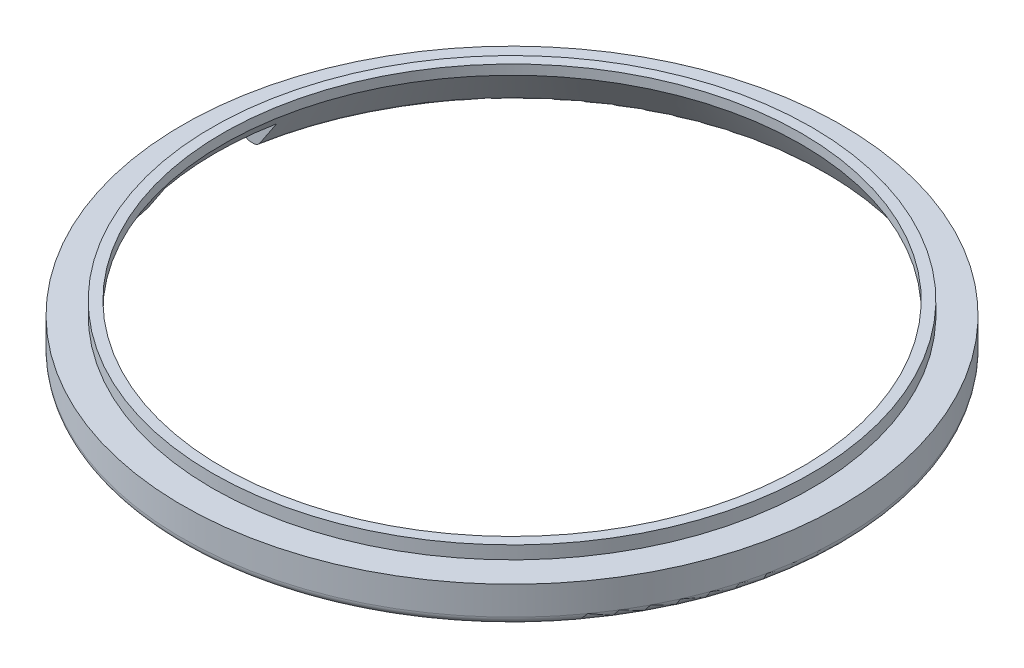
from build123d import *

# Parameters (mm, degrees)
SKETCH1_R           = 12.7
SKETCH1_R_2         = 11.15
BOSS_EXTRUDE1_DEPTH = 1.9
SKETCH2_W           = 4.3
SKETCH2_H           = 1.1
CUT_EXTRUDE1_DEPTH  = 19.060730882
FILLET2_R           = 0.3
SKETCH6_OUTSIDE_W   = 34.594
SKETCH6_OUTSIDE_H   = 34.594
SKETCH6_OUTSIDE_R   = 11.55
CUT_EXTRUDE4_DEPTH  = 0.5


with BuildPart() as part:
    # Sketch1 → Boss-Extrude1 (new body)
    with BuildSketch(Plane(origin=(0, 0, 0), x_dir=(1, 0, 0), z_dir=(0, 1, 0))):
        with Locations(Location((0, 0, 0), (0, 0, 90))):
            Circle(SKETCH1_R)
        with Locations(Location((0, 0, 0), (0, 0, 90))):
            Circle(SKETCH1_R_2, mode=Mode.SUBTRACT)
    extrude(amount=BOSS_EXTRUDE1_DEPTH)

    # Sketch2 → Cut-Extrude1 (cut, through all)
    with BuildSketch(Plane(origin=(0, 0, 0), x_dir=(0, 0, -1), z_dir=(1, 0, 0))):
        with Locations((0, 0.55)):
            Rectangle(SKETCH2_W, SKETCH2_H)
    extrude(amount=-CUT_EXTRUDE1_DEPTH, mode=Mode.SUBTRACT)

    # Sketch5 → Cut-Revolve1 (revolve, cut)
    with BuildSketch(Plane.XY, mode=Mode.PRIVATE) as cut_revolve1_sk:
        Polygon((12.15, 0), (11.15, 1.525253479), (11.15, 0), align=None)
    revolve(cut_revolve1_sk.sketch.rotate(Axis((0, 0, 0), (0, 1, 0)), 90), axis=Axis((0, 0, 0), (0, 1, 0)), mode=Mode.SUBTRACT)

    # Fillet2
    fillet2_edges = [part.edges().sort_by_distance(p)[0] for p in [
        (9.710689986, 0, 8.184894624),
        (9.32054183, 0, 7.794228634),
        (-12.7, 1.1, 0),
    ]]
    fillet(fillet2_edges, radius=FILLET2_R)

    # Sketch6 outside → Cut-Extrude4 (cut)
    with BuildSketch(Plane(origin=(0, 1.9, 0), x_dir=(1, 0, 0), z_dir=(0, 1, 0))):
        Rectangle(SKETCH6_OUTSIDE_W, SKETCH6_OUTSIDE_H)
        with Locations(Location((0, 0, 0), (0, 0, 270))):
            Circle(SKETCH6_OUTSIDE_R, mode=Mode.SUBTRACT)
    extrude(amount=-CUT_EXTRUDE4_DEPTH, mode=Mode.SUBTRACT)


solid = part.part
